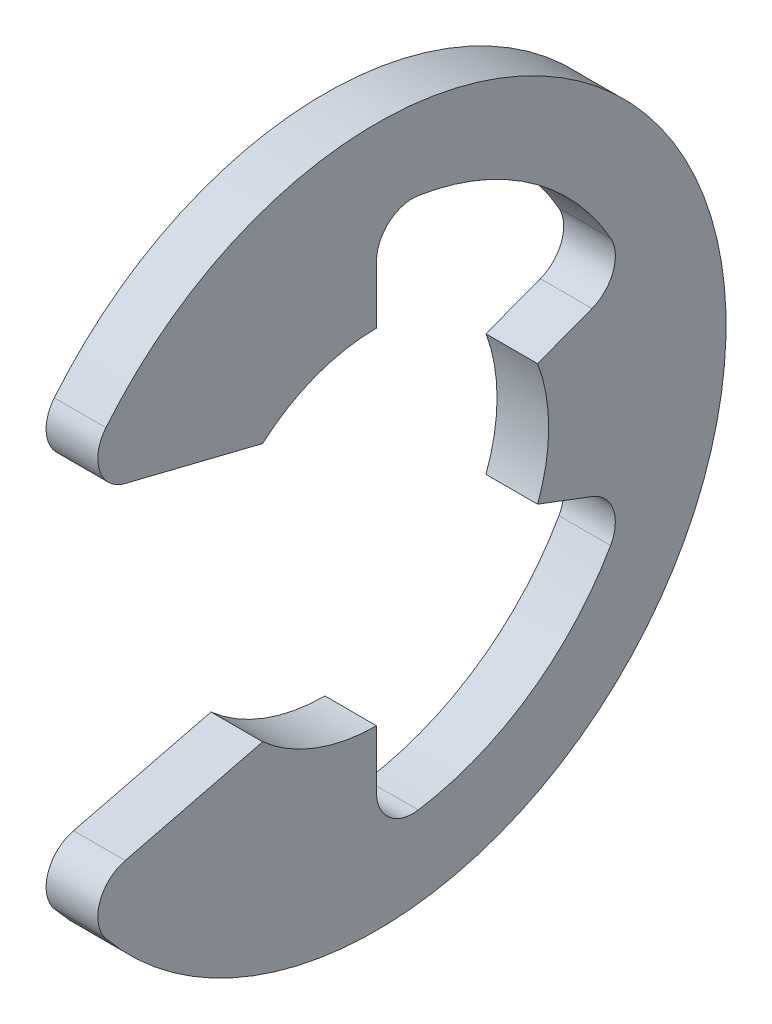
ISO-10303-21;
HEADER;
FILE_DESCRIPTION(('STEP AP214'),'2;1');
FILE_NAME('part.step','',(''),(''),'','','');
FILE_SCHEMA(('AUTOMOTIVE_DESIGN { 1 0 10303 214 1 1 1 1 }'));
ENDSEC;
DATA;
#1=APPLICATION_CONTEXT('core data for automotive mechanical design processes');
#2=APPLICATION_PROTOCOL_DEFINITION('international standard','automotive_design',2000,#1);
#3=PRODUCT_CONTEXT('',#1,'mechanical');
#4=PRODUCT('Part','Part','',(#3));
#5=PRODUCT_RELATED_PRODUCT_CATEGORY('part','',(#4));
#6=PRODUCT_DEFINITION_FORMATION('','',#4);
#7=PRODUCT_DEFINITION_CONTEXT('part definition',#1,'design');
#8=PRODUCT_DEFINITION('design','',#6,#7);
#9=PRODUCT_DEFINITION_SHAPE('','',#8);
#10=(LENGTH_UNIT() NAMED_UNIT(*) SI_UNIT(.MILLI.,.METRE.));
#11=(NAMED_UNIT(*) PLANE_ANGLE_UNIT() SI_UNIT($,.RADIAN.));
#12=(NAMED_UNIT(*) SI_UNIT($,.STERADIAN.) SOLID_ANGLE_UNIT());
#13=UNCERTAINTY_MEASURE_WITH_UNIT(LENGTH_MEASURE(1.E-05),#10,'distance_accuracy_value','');
#14=(GEOMETRIC_REPRESENTATION_CONTEXT(3) GLOBAL_UNCERTAINTY_ASSIGNED_CONTEXT((#13)) GLOBAL_UNIT_ASSIGNED_CONTEXT((#10,
#11,#12)) REPRESENTATION_CONTEXT('',''));
#15=CARTESIAN_POINT('',(0.,0.,0.));
#16=DIRECTION('',(0.,0.,1.));
#17=DIRECTION('',(1.,0.,0.));
#18=AXIS2_PLACEMENT_3D('',#15,#16,#17);
#19=CARTESIAN_POINT('',(0.1905,0.,0.));
#20=DIRECTION('',(-1.,0.,0.));
#21=DIRECTION('',(0.,0.,1.));
#22=AXIS2_PLACEMENT_3D('',#19,#20,#21);
#23=CYLINDRICAL_SURFACE('',#22,2.5781);
#24=CARTESIAN_POINT('',(0.1905,0.,0.));
#25=DIRECTION('',(1.,0.,0.));
#26=DIRECTION('',(0.,0.,-1.));
#27=AXIS2_PLACEMENT_3D('',#24,#25,#26);
#28=CIRCLE('',#27,2.5781);
#29=CARTESIAN_POINT('',(0.1905,-1.63181917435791,1.99593732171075));
#30=VERTEX_POINT('',#29);
#31=CARTESIAN_POINT('',(0.1905,1.63181917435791,1.99593732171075));
#32=VERTEX_POINT('',#31);
#33=EDGE_CURVE('E215',#30,#32,#28,.T.);
#34=ORIENTED_EDGE('',*,*,#33,.F.);
#35=DIRECTION('',(-1.,0.,0.));
#36=VECTOR('',#35,1.);
#37=CARTESIAN_POINT('',(0.1905,-1.63181917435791,1.99593732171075));
#38=LINE('',#37,#36);
#39=CARTESIAN_POINT('',(-0.1905,-1.63181917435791,1.99593732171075));
#40=VERTEX_POINT('',#39);
#41=EDGE_CURVE('E344',#30,#40,#38,.T.);
#42=ORIENTED_EDGE('',*,*,#41,.T.);
#43=CARTESIAN_POINT('',(-0.1905,0.,0.));
#44=DIRECTION('',(1.,0.,0.));
#45=DIRECTION('',(0.,0.,-1.));
#46=AXIS2_PLACEMENT_3D('',#43,#44,#45);
#47=CIRCLE('',#46,2.5781);
#48=CARTESIAN_POINT('',(-0.1905,1.63181917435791,1.99593732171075));
#49=VERTEX_POINT('',#48);
#50=EDGE_CURVE('E265',#40,#49,#47,.T.);
#51=ORIENTED_EDGE('',*,*,#50,.T.);
#52=DIRECTION('',(-1.,0.,0.));
#53=VECTOR('',#52,1.);
#54=CARTESIAN_POINT('',(0.1905,1.63181917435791,1.99593732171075));
#55=LINE('',#54,#53);
#56=EDGE_CURVE('E342',#49,#32,#55,.F.);
#57=ORIENTED_EDGE('',*,*,#56,.T.);
#58=EDGE_LOOP('',(#34,#42,#51,#57));
#59=FACE_BOUND('',#58,.T.);
#60=ADVANCED_FACE('F39',(#59),#23,.T.);
#61=CARTESIAN_POINT('',(0.1905,1.29709748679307,2.22803449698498));
#62=DIRECTION('',(0.,0.970536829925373,-0.240952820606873));
#63=DIRECTION('',(0.,0.240952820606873,0.970536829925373));
#64=AXIS2_PLACEMENT_3D('',#61,#62,#63);
#65=PLANE('',#64);
#66=DIRECTION('',(0.,-0.240952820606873,-0.970536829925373));
#67=VECTOR('',#66,1.);
#68=CARTESIAN_POINT('',(0.1905,1.29709748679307,2.22803449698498));
#69=LINE('',#68,#67);
#70=CARTESIAN_POINT('',(0.1905,1.20416812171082,1.85372316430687));
#71=VERTEX_POINT('',#70);
#72=CARTESIAN_POINT('',(0.1905,0.9525,0.840026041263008));
#73=VERTEX_POINT('',#72);
#74=EDGE_CURVE('E200',#71,#73,#69,.T.);
#75=ORIENTED_EDGE('',*,*,#74,.F.);
#76=DIRECTION('',(-1.,0.,0.));
#77=VECTOR('',#76,1.);
#78=CARTESIAN_POINT('',(0.1905,1.20416812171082,1.85372316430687));
#79=LINE('',#78,#77);
#80=CARTESIAN_POINT('',(-0.1905,1.20416812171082,1.85372316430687));
#81=VERTEX_POINT('',#80);
#82=EDGE_CURVE('E362',#71,#81,#79,.T.);
#83=ORIENTED_EDGE('',*,*,#82,.T.);
#84=DIRECTION('',(0.,-0.240952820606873,-0.970536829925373));
#85=VECTOR('',#84,1.);
#86=CARTESIAN_POINT('',(-0.1905,1.29709748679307,2.22803449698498));
#87=LINE('',#86,#85);
#88=CARTESIAN_POINT('',(-0.1905,0.9525,0.840026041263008));
#89=VERTEX_POINT('',#88);
#90=EDGE_CURVE('E221',#81,#89,#87,.T.);
#91=ORIENTED_EDGE('',*,*,#90,.T.);
#92=DIRECTION('',(-1.,0.,0.));
#93=VECTOR('',#92,1.);
#94=CARTESIAN_POINT('',(0.1905,0.9525,0.840026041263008));
#95=LINE('',#94,#93);
#96=EDGE_CURVE('E218',#73,#89,#95,.T.);
#97=ORIENTED_EDGE('',*,*,#96,.F.);
#98=EDGE_LOOP('',(#75,#83,#91,#97));
#99=FACE_BOUND('',#98,.T.);
#100=ADVANCED_FACE('F219',(#99),#65,.F.);
#101=CARTESIAN_POINT('',(0.1905,0.,0.));
#102=DIRECTION('',(-1.,0.,0.));
#103=DIRECTION('',(0.,0.,1.));
#104=AXIS2_PLACEMENT_3D('',#101,#102,#103);
#105=CYLINDRICAL_SURFACE('',#104,1.27);
#106=CARTESIAN_POINT('',(-0.1905,0.,0.));
#107=DIRECTION('',(-1.,0.,0.));
#108=DIRECTION('',(0.,0.,1.));
#109=AXIS2_PLACEMENT_3D('',#106,#107,#108);
#110=CIRCLE('',#109,1.27);
#111=CARTESIAN_POINT('',(-0.1905,1.27,0.));
#112=VERTEX_POINT('',#111);
#113=EDGE_CURVE('E271',#89,#112,#110,.T.);
#114=ORIENTED_EDGE('',*,*,#113,.T.);
#115=DIRECTION('',(-1.,0.,0.));
#116=VECTOR('',#115,1.);
#117=CARTESIAN_POINT('',(0.1905,1.27,0.));
#118=LINE('',#117,#116);
#119=CARTESIAN_POINT('',(0.1905,1.27,0.));
#120=VERTEX_POINT('',#119);
#121=EDGE_CURVE('E226',#120,#112,#118,.T.);
#122=ORIENTED_EDGE('',*,*,#121,.F.);
#123=CARTESIAN_POINT('',(0.1905,0.,0.));
#124=DIRECTION('',(-1.,0.,0.));
#125=DIRECTION('',(0.,0.,1.));
#126=AXIS2_PLACEMENT_3D('',#123,#124,#125);
#127=CIRCLE('',#126,1.27);
#128=EDGE_CURVE('E206',#73,#120,#127,.T.);
#129=ORIENTED_EDGE('',*,*,#128,.F.);
#130=ORIENTED_EDGE('',*,*,#96,.T.);
#131=EDGE_LOOP('',(#114,#122,#129,#130));
#132=FACE_BOUND('',#131,.T.);
#133=ADVANCED_FACE('F228',(#132),#105,.F.);
#134=CARTESIAN_POINT('',(0.1905,1.27,0.));
#135=DIRECTION('',(0.,0.,1.));
#136=DIRECTION('',(0.,-1.,0.));
#137=AXIS2_PLACEMENT_3D('',#134,#135,#136);
#138=PLANE('',#137);
#139=DIRECTION('',(0.,1.,0.));
#140=VECTOR('',#139,1.);
#141=CARTESIAN_POINT('',(-0.1905,1.27,0.));
#142=LINE('',#141,#140);
#143=CARTESIAN_POINT('',(-0.1905,1.69860617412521,0.));
#144=VERTEX_POINT('',#143);
#145=EDGE_CURVE('E274',#112,#144,#142,.T.);
#146=ORIENTED_EDGE('',*,*,#145,.T.);
#147=DIRECTION('',(1.,0.,0.));
#148=VECTOR('',#147,1.);
#149=CARTESIAN_POINT('',(0.1905,1.69860617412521,0.));
#150=LINE('',#149,#148);
#151=CARTESIAN_POINT('',(0.1905,1.69860617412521,0.));
#152=VERTEX_POINT('',#151);
#153=EDGE_CURVE('E339',#144,#152,#150,.T.);
#154=ORIENTED_EDGE('',*,*,#153,.T.);
#155=DIRECTION('',(0.,1.,0.));
#156=VECTOR('',#155,1.);
#157=CARTESIAN_POINT('',(0.1905,1.27,0.));
#158=LINE('',#157,#156);
#159=EDGE_CURVE('E232',#120,#152,#158,.T.);
#160=ORIENTED_EDGE('',*,*,#159,.F.);
#161=ORIENTED_EDGE('',*,*,#121,.T.);
#162=EDGE_LOOP('',(#146,#154,#160,#161));
#163=FACE_BOUND('',#162,.T.);
#164=ADVANCED_FACE('F479',(#163),#138,.F.);
#165=CARTESIAN_POINT('',(0.1905,0.,0.));
#166=DIRECTION('',(-1.,0.,0.));
#167=DIRECTION('',(0.,0.,1.));
#168=AXIS2_PLACEMENT_3D('',#165,#166,#167);
#169=CYLINDRICAL_SURFACE('',#168,1.98611612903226);
#170=CARTESIAN_POINT('',(0.1905,0.,0.));
#171=DIRECTION('',(-1.,0.,0.));
#172=DIRECTION('',(0.,0.,-1.));
#173=AXIS2_PLACEMENT_3D('',#170,#171,#172);
#174=CIRCLE('',#173,1.98611612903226);
#175=CARTESIAN_POINT('',(0.1905,1.96207832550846,-0.308068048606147));
#176=VERTEX_POINT('',#175);
#177=CARTESIAN_POINT('',(0.1905,0.981870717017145,-1.72643771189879));
#178=VERTEX_POINT('',#177);
#179=EDGE_CURVE('E236',#176,#178,#174,.T.);
#180=ORIENTED_EDGE('',*,*,#179,.F.);
#181=DIRECTION('',(-1.,0.,0.));
#182=VECTOR('',#181,1.);
#183=CARTESIAN_POINT('',(0.1905,1.96207832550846,-0.308068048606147));
#184=LINE('',#183,#182);
#185=CARTESIAN_POINT('',(-0.1905,1.96207832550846,-0.308068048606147));
#186=VERTEX_POINT('',#185);
#187=EDGE_CURVE('E335',#176,#186,#184,.T.);
#188=ORIENTED_EDGE('',*,*,#187,.T.);
#189=CARTESIAN_POINT('',(-0.1905,0.,0.));
#190=DIRECTION('',(-1.,0.,0.));
#191=DIRECTION('',(0.,0.,-1.));
#192=AXIS2_PLACEMENT_3D('',#189,#190,#191);
#193=CIRCLE('',#192,1.98611612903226);
#194=CARTESIAN_POINT('',(-0.1905,0.981870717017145,-1.72643771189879));
#195=VERTEX_POINT('',#194);
#196=EDGE_CURVE('E278',#186,#195,#193,.T.);
#197=ORIENTED_EDGE('',*,*,#196,.T.);
#198=DIRECTION('',(-1.,0.,0.));
#199=VECTOR('',#198,1.);
#200=CARTESIAN_POINT('',(0.1905,0.981870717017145,-1.72643771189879));
#201=LINE('',#200,#199);
#202=EDGE_CURVE('E332',#195,#178,#201,.F.);
#203=ORIENTED_EDGE('',*,*,#202,.T.);
#204=EDGE_LOOP('',(#180,#188,#197,#203));
#205=FACE_BOUND('',#204,.T.);
#206=ADVANCED_FACE('F400',(#205),#169,.F.);
#207=CARTESIAN_POINT('',(0.1905,0.449012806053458,-1.18797622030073));
#208=DIRECTION('',(0.,-0.935414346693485,-0.353553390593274));
#209=DIRECTION('',(0.,0.353553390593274,-0.935414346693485));
#210=AXIS2_PLACEMENT_3D('',#207,#208,#209);
#211=PLANE('',#210);
#212=DIRECTION('',(0.,-0.353553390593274,0.935414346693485));
#213=VECTOR('',#212,1.);
#214=CARTESIAN_POINT('',(0.1905,0.449012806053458,-1.18797622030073));
#215=LINE('',#214,#213);
#216=CARTESIAN_POINT('',(0.1905,0.600547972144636,-1.58890058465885));
#217=VERTEX_POINT('',#216);
#218=CARTESIAN_POINT('',(0.1905,0.449012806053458,-1.18797622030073));
#219=VERTEX_POINT('',#218);
#220=EDGE_CURVE('E242',#217,#219,#215,.T.);
#221=ORIENTED_EDGE('',*,*,#220,.F.);
#222=DIRECTION('',(1.,0.,0.));
#223=VECTOR('',#222,1.);
#224=CARTESIAN_POINT('',(-0.1905,0.600547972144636,-1.58890058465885));
#225=LINE('',#224,#223);
#226=CARTESIAN_POINT('',(-0.1905,0.600547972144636,-1.58890058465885));
#227=VERTEX_POINT('',#226);
#228=EDGE_CURVE('E367',#217,#227,#225,.F.);
#229=ORIENTED_EDGE('',*,*,#228,.T.);
#230=DIRECTION('',(0.,-0.353553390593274,0.935414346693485));
#231=VECTOR('',#230,1.);
#232=CARTESIAN_POINT('',(-0.1905,0.449012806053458,-1.18797622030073));
#233=LINE('',#232,#231);
#234=CARTESIAN_POINT('',(-0.1905,0.449012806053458,-1.18797622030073));
#235=VERTEX_POINT('',#234);
#236=EDGE_CURVE('E282',#227,#235,#233,.T.);
#237=ORIENTED_EDGE('',*,*,#236,.T.);
#238=DIRECTION('',(-1.,0.,0.));
#239=VECTOR('',#238,1.);
#240=CARTESIAN_POINT('',(0.1905,0.449012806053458,-1.18797622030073));
#241=LINE('',#240,#239);
#242=EDGE_CURVE('E316',#219,#235,#241,.T.);
#243=ORIENTED_EDGE('',*,*,#242,.F.);
#244=EDGE_LOOP('',(#221,#229,#237,#243));
#245=FACE_BOUND('',#244,.T.);
#246=ADVANCED_FACE('F403',(#245),#211,.F.);
#247=CARTESIAN_POINT('',(0.1905,0.,0.));
#248=DIRECTION('',(-1.,0.,0.));
#249=DIRECTION('',(0.,0.,1.));
#250=AXIS2_PLACEMENT_3D('',#247,#248,#249);
#251=CYLINDRICAL_SURFACE('',#250,1.27);
#252=CARTESIAN_POINT('',(-0.1905,0.,0.));
#253=DIRECTION('',(-1.,0.,0.));
#254=DIRECTION('',(0.,0.,1.));
#255=AXIS2_PLACEMENT_3D('',#252,#253,#254);
#256=CIRCLE('',#255,1.27);
#257=CARTESIAN_POINT('',(-0.1905,-0.449012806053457,-1.18797622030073));
#258=VERTEX_POINT('',#257);
#259=EDGE_CURVE('E285',#235,#258,#256,.T.);
#260=ORIENTED_EDGE('',*,*,#259,.T.);
#261=DIRECTION('',(-1.,0.,0.));
#262=VECTOR('',#261,1.);
#263=CARTESIAN_POINT('',(0.1905,-0.449012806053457,-1.18797622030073));
#264=LINE('',#263,#262);
#265=CARTESIAN_POINT('',(0.1905,-0.449012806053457,-1.18797622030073));
#266=VERTEX_POINT('',#265);
#267=EDGE_CURVE('E312',#266,#258,#264,.T.);
#268=ORIENTED_EDGE('',*,*,#267,.F.);
#269=CARTESIAN_POINT('',(0.1905,0.,0.));
#270=DIRECTION('',(-1.,0.,0.));
#271=DIRECTION('',(0.,0.,1.));
#272=AXIS2_PLACEMENT_3D('',#269,#270,#271);
#273=CIRCLE('',#272,1.27);
#274=EDGE_CURVE('E245',#219,#266,#273,.T.);
#275=ORIENTED_EDGE('',*,*,#274,.F.);
#276=ORIENTED_EDGE('',*,*,#242,.T.);
#277=EDGE_LOOP('',(#260,#268,#275,#276));
#278=FACE_BOUND('',#277,.T.);
#279=ADVANCED_FACE('F409',(#278),#251,.F.);
#280=CARTESIAN_POINT('',(0.1905,-0.449012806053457,-1.18797622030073));
#281=DIRECTION('',(0.,0.935414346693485,-0.353553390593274));
#282=DIRECTION('',(0.,0.353553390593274,0.935414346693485));
#283=AXIS2_PLACEMENT_3D('',#280,#281,#282);
#284=PLANE('',#283);
#285=DIRECTION('',(0.,-0.353553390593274,-0.935414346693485));
#286=VECTOR('',#285,1.);
#287=CARTESIAN_POINT('',(-0.1905,-0.449012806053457,-1.18797622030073));
#288=LINE('',#287,#286);
#289=CARTESIAN_POINT('',(-0.1905,-0.600547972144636,-1.58890058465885));
#290=VERTEX_POINT('',#289);
#291=EDGE_CURVE('E288',#258,#290,#288,.T.);
#292=ORIENTED_EDGE('',*,*,#291,.T.);
#293=DIRECTION('',(1.,0.,0.));
#294=VECTOR('',#293,1.);
#295=CARTESIAN_POINT('',(0.1905,-0.600547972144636,-1.58890058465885));
#296=LINE('',#295,#294);
#297=CARTESIAN_POINT('',(0.1905,-0.600547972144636,-1.58890058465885));
#298=VERTEX_POINT('',#297);
#299=EDGE_CURVE('E58',#290,#298,#296,.T.);
#300=ORIENTED_EDGE('',*,*,#299,.T.);
#301=DIRECTION('',(0.,-0.353553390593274,-0.935414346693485));
#302=VECTOR('',#301,1.);
#303=CARTESIAN_POINT('',(0.1905,-0.449012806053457,-1.18797622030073));
#304=LINE('',#303,#302);
#305=EDGE_CURVE('E248',#266,#298,#304,.T.);
#306=ORIENTED_EDGE('',*,*,#305,.F.);
#307=ORIENTED_EDGE('',*,*,#267,.T.);
#308=EDGE_LOOP('',(#292,#300,#306,#307));
#309=FACE_BOUND('',#308,.T.);
#310=ADVANCED_FACE('F411',(#309),#284,.F.);
#311=CARTESIAN_POINT('',(0.1905,0.,0.));
#312=DIRECTION('',(-1.,0.,0.));
#313=DIRECTION('',(0.,0.,1.));
#314=AXIS2_PLACEMENT_3D('',#311,#312,#313);
#315=CYLINDRICAL_SURFACE('',#314,1.98611612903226);
#316=CARTESIAN_POINT('',(-0.1905,0.,0.));
#317=DIRECTION('',(-1.,0.,0.));
#318=DIRECTION('',(0.,0.,-1.));
#319=AXIS2_PLACEMENT_3D('',#316,#317,#318);
#320=CIRCLE('',#319,1.98611612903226);
#321=CARTESIAN_POINT('',(-0.1905,-0.981870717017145,-1.72643771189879));
#322=VERTEX_POINT('',#321);
#323=CARTESIAN_POINT('',(-0.1905,-1.96207832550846,-0.308068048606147));
#324=VERTEX_POINT('',#323);
#325=EDGE_CURVE('E291',#322,#324,#320,.T.);
#326=ORIENTED_EDGE('',*,*,#325,.T.);
#327=DIRECTION('',(-1.,0.,0.));
#328=VECTOR('',#327,1.);
#329=CARTESIAN_POINT('',(0.1905,-1.96207832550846,-0.308068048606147));
#330=LINE('',#329,#328);
#331=CARTESIAN_POINT('',(0.1905,-1.96207832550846,-0.308068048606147));
#332=VERTEX_POINT('',#331);
#333=EDGE_CURVE('E329',#324,#332,#330,.F.);
#334=ORIENTED_EDGE('',*,*,#333,.T.);
#335=CARTESIAN_POINT('',(0.1905,0.,0.));
#336=DIRECTION('',(-1.,0.,0.));
#337=DIRECTION('',(0.,0.,-1.));
#338=AXIS2_PLACEMENT_3D('',#335,#336,#337);
#339=CIRCLE('',#338,1.98611612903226);
#340=CARTESIAN_POINT('',(0.1905,-0.981870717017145,-1.72643771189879));
#341=VERTEX_POINT('',#340);
#342=EDGE_CURVE('E251',#341,#332,#339,.T.);
#343=ORIENTED_EDGE('',*,*,#342,.F.);
#344=DIRECTION('',(-1.,0.,0.));
#345=VECTOR('',#344,1.);
#346=CARTESIAN_POINT('',(0.1905,-0.981870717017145,-1.72643771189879));
#347=LINE('',#346,#345);
#348=EDGE_CURVE('E325',#341,#322,#347,.T.);
#349=ORIENTED_EDGE('',*,*,#348,.T.);
#350=EDGE_LOOP('',(#326,#334,#343,#349));
#351=FACE_BOUND('',#350,.T.);
#352=ADVANCED_FACE('F413',(#351),#315,.F.);
#353=CARTESIAN_POINT('',(0.1905,-1.27,0.));
#354=DIRECTION('',(0.,0.,1.));
#355=DIRECTION('',(0.,-1.,0.));
#356=AXIS2_PLACEMENT_3D('',#353,#354,#355);
#357=PLANE('',#356);
#358=DIRECTION('',(0.,1.,0.));
#359=VECTOR('',#358,1.);
#360=CARTESIAN_POINT('',(0.1905,-1.27,0.));
#361=LINE('',#360,#359);
#362=CARTESIAN_POINT('',(0.1905,-1.69860617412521,0.));
#363=VERTEX_POINT('',#362);
#364=CARTESIAN_POINT('',(0.1905,-1.27,0.));
#365=VERTEX_POINT('',#364);
#366=EDGE_CURVE('E255',#363,#365,#361,.T.);
#367=ORIENTED_EDGE('',*,*,#366,.F.);
#368=DIRECTION('',(1.,0.,0.));
#369=VECTOR('',#368,1.);
#370=CARTESIAN_POINT('',(-0.1905,-1.69860617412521,0.));
#371=LINE('',#370,#369);
#372=CARTESIAN_POINT('',(-0.1905,-1.69860617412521,0.));
#373=VERTEX_POINT('',#372);
#374=EDGE_CURVE('E225',#363,#373,#371,.F.);
#375=ORIENTED_EDGE('',*,*,#374,.T.);
#376=DIRECTION('',(0.,1.,0.));
#377=VECTOR('',#376,1.);
#378=CARTESIAN_POINT('',(-0.1905,-1.27,0.));
#379=LINE('',#378,#377);
#380=CARTESIAN_POINT('',(-0.1905,-1.27,0.));
#381=VERTEX_POINT('',#380);
#382=EDGE_CURVE('E295',#373,#381,#379,.T.);
#383=ORIENTED_EDGE('',*,*,#382,.T.);
#384=DIRECTION('',(-1.,0.,0.));
#385=VECTOR('',#384,1.);
#386=CARTESIAN_POINT('',(0.1905,-1.27,0.));
#387=LINE('',#386,#385);
#388=EDGE_CURVE('E308',#365,#381,#387,.T.);
#389=ORIENTED_EDGE('',*,*,#388,.F.);
#390=EDGE_LOOP('',(#367,#375,#383,#389));
#391=FACE_BOUND('',#390,.T.);
#392=ADVANCED_FACE('F419',(#391),#357,.F.);
#393=CARTESIAN_POINT('',(0.1905,0.,0.));
#394=DIRECTION('',(-1.,0.,0.));
#395=DIRECTION('',(0.,0.,1.));
#396=AXIS2_PLACEMENT_3D('',#393,#394,#395);
#397=CYLINDRICAL_SURFACE('',#396,1.27);
#398=CARTESIAN_POINT('',(-0.1905,0.,0.));
#399=DIRECTION('',(-1.,0.,0.));
#400=DIRECTION('',(0.,0.,-1.));
#401=AXIS2_PLACEMENT_3D('',#398,#399,#400);
#402=CIRCLE('',#401,1.27);
#403=CARTESIAN_POINT('',(-0.1905,-0.9525,0.840026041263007));
#404=VERTEX_POINT('',#403);
#405=EDGE_CURVE('E298',#381,#404,#402,.T.);
#406=ORIENTED_EDGE('',*,*,#405,.T.);
#407=DIRECTION('',(-1.,0.,0.));
#408=VECTOR('',#407,1.);
#409=CARTESIAN_POINT('',(0.1905,-0.9525,0.840026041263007));
#410=LINE('',#409,#408);
#411=CARTESIAN_POINT('',(0.1905,-0.9525,0.840026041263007));
#412=VERTEX_POINT('',#411);
#413=EDGE_CURVE('E264',#412,#404,#410,.T.);
#414=ORIENTED_EDGE('',*,*,#413,.F.);
#415=CARTESIAN_POINT('',(0.1905,0.,0.));
#416=DIRECTION('',(-1.,0.,0.));
#417=DIRECTION('',(0.,0.,-1.));
#418=AXIS2_PLACEMENT_3D('',#415,#416,#417);
#419=CIRCLE('',#418,1.27);
#420=EDGE_CURVE('E258',#365,#412,#419,.T.);
#421=ORIENTED_EDGE('',*,*,#420,.F.);
#422=ORIENTED_EDGE('',*,*,#388,.T.);
#423=EDGE_LOOP('',(#406,#414,#421,#422));
#424=FACE_BOUND('',#423,.T.);
#425=ADVANCED_FACE('F468',(#424),#397,.F.);
#426=CARTESIAN_POINT('',(0.1905,-1.29709748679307,2.22803449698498));
#427=DIRECTION('',(0.,-0.970536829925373,-0.240952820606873));
#428=DIRECTION('',(0.,0.240952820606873,-0.970536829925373));
#429=AXIS2_PLACEMENT_3D('',#426,#427,#428);
#430=PLANE('',#429);
#431=DIRECTION('',(0.,-0.240952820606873,0.970536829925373));
#432=VECTOR('',#431,1.);
#433=CARTESIAN_POINT('',(-0.1905,-1.29709748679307,2.22803449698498));
#434=LINE('',#433,#432);
#435=CARTESIAN_POINT('',(-0.1905,-1.20416812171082,1.85372316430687));
#436=VERTEX_POINT('',#435);
#437=EDGE_CURVE('E301',#404,#436,#434,.T.);
#438=ORIENTED_EDGE('',*,*,#437,.T.);
#439=DIRECTION('',(-1.,0.,0.));
#440=VECTOR('',#439,1.);
#441=CARTESIAN_POINT('',(0.1905,-1.20416812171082,1.85372316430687));
#442=LINE('',#441,#440);
#443=CARTESIAN_POINT('',(0.1905,-1.20416812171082,1.85372316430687));
#444=VERTEX_POINT('',#443);
#445=EDGE_CURVE('E354',#436,#444,#442,.F.);
#446=ORIENTED_EDGE('',*,*,#445,.T.);
#447=DIRECTION('',(0.,-0.240952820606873,0.970536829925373));
#448=VECTOR('',#447,1.);
#449=CARTESIAN_POINT('',(0.1905,-1.29709748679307,2.22803449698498));
#450=LINE('',#449,#448);
#451=EDGE_CURVE('E261',#412,#444,#450,.T.);
#452=ORIENTED_EDGE('',*,*,#451,.F.);
#453=ORIENTED_EDGE('',*,*,#413,.T.);
#454=EDGE_LOOP('',(#438,#446,#452,#453));
#455=FACE_BOUND('',#454,.T.);
#456=ADVANCED_FACE('F514',(#455),#430,.F.);
#457=CARTESIAN_POINT('',(0.1905,0.,0.));
#458=DIRECTION('',(1.,0.,0.));
#459=DIRECTION('',(0.,0.,-1.));
#460=AXIS2_PLACEMENT_3D('',#457,#458,#459);
#461=PLANE('',#460);
#462=ORIENTED_EDGE('',*,*,#451,.T.);
#463=CARTESIAN_POINT('',(0.1905,-1.46301029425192,1.78946104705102));
#464=DIRECTION('',(1.,0.,0.));
#465=DIRECTION('',(0.,0.,-1.));
#466=AXIS2_PLACEMENT_3D('',#463,#464,#465);
#467=CIRCLE('',#466,0.2667);
#468=EDGE_CURVE('E359',#444,#30,#467,.T.);
#469=ORIENTED_EDGE('',*,*,#468,.T.);
#470=ORIENTED_EDGE('',*,*,#33,.T.);
#471=CARTESIAN_POINT('',(0.1905,1.46301029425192,1.78946104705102));
#472=DIRECTION('',(1.,0.,0.));
#473=DIRECTION('',(0.,0.,-1.));
#474=AXIS2_PLACEMENT_3D('',#471,#472,#473);
#475=CIRCLE('',#474,0.2667);
#476=EDGE_CURVE('E210',#32,#71,#475,.T.);
#477=ORIENTED_EDGE('',*,*,#476,.T.);
#478=ORIENTED_EDGE('',*,*,#74,.T.);
#479=ORIENTED_EDGE('',*,*,#128,.T.);
#480=ORIENTED_EDGE('',*,*,#159,.T.);
#481=CARTESIAN_POINT('',(0.1905,1.69860617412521,-0.266699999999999));
#482=DIRECTION('',(1.,0.,0.));
#483=DIRECTION('',(0.,0.,-1.));
#484=AXIS2_PLACEMENT_3D('',#481,#482,#483);
#485=CIRCLE('',#484,0.2667);
#486=EDGE_CURVE('E380',#152,#176,#485,.F.);
#487=ORIENTED_EDGE('',*,*,#486,.T.);
#488=ORIENTED_EDGE('',*,*,#179,.T.);
#489=CARTESIAN_POINT('',(0.1905,0.850022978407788,-1.49460789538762));
#490=DIRECTION('',(1.,0.,0.));
#491=DIRECTION('',(0.,0.,-1.));
#492=AXIS2_PLACEMENT_3D('',#489,#490,#491);
#493=CIRCLE('',#492,0.2667);
#494=EDGE_CURVE('E11',#178,#217,#493,.F.);
#495=ORIENTED_EDGE('',*,*,#494,.T.);
#496=ORIENTED_EDGE('',*,*,#220,.T.);
#497=ORIENTED_EDGE('',*,*,#274,.T.);
#498=ORIENTED_EDGE('',*,*,#305,.T.);
#499=CARTESIAN_POINT('',(0.1905,-0.850022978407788,-1.49460789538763));
#500=DIRECTION('',(1.,0.,0.));
#501=DIRECTION('',(0.,0.,-1.));
#502=AXIS2_PLACEMENT_3D('',#499,#500,#501);
#503=CIRCLE('',#502,0.2667);
#504=EDGE_CURVE('E386',#298,#341,#503,.F.);
#505=ORIENTED_EDGE('',*,*,#504,.T.);
#506=ORIENTED_EDGE('',*,*,#342,.T.);
#507=CARTESIAN_POINT('',(0.1905,-1.69860617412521,-0.2667));
#508=DIRECTION('',(1.,0.,0.));
#509=DIRECTION('',(0.,0.,-1.));
#510=AXIS2_PLACEMENT_3D('',#507,#508,#509);
#511=CIRCLE('',#510,0.2667);
#512=EDGE_CURVE('E374',#332,#363,#511,.F.);
#513=ORIENTED_EDGE('',*,*,#512,.T.);
#514=ORIENTED_EDGE('',*,*,#366,.T.);
#515=ORIENTED_EDGE('',*,*,#420,.T.);
#516=EDGE_LOOP('',(#462,#469,#470,#477,#478,#479,#480,#487,#488,#495,#496,#497,#498,#505,#506,
#513,#514,#515));
#517=FACE_BOUND('',#516,.T.);
#518=ADVANCED_FACE('F203',(#517),#461,.T.);
#519=CARTESIAN_POINT('',(-0.1905,0.,0.));
#520=DIRECTION('',(1.,0.,0.));
#521=DIRECTION('',(0.,0.,-1.));
#522=AXIS2_PLACEMENT_3D('',#519,#520,#521);
#523=PLANE('',#522);
#524=ORIENTED_EDGE('',*,*,#50,.F.);
#525=CARTESIAN_POINT('',(-0.1905,-1.46301029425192,1.78946104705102));
#526=DIRECTION('',(1.,0.,0.));
#527=DIRECTION('',(0.,0.,-1.));
#528=AXIS2_PLACEMENT_3D('',#525,#526,#527);
#529=CIRCLE('',#528,0.2667);
#530=EDGE_CURVE('E351',#40,#436,#529,.F.);
#531=ORIENTED_EDGE('',*,*,#530,.T.);
#532=ORIENTED_EDGE('',*,*,#437,.F.);
#533=ORIENTED_EDGE('',*,*,#405,.F.);
#534=ORIENTED_EDGE('',*,*,#382,.F.);
#535=CARTESIAN_POINT('',(-0.1905,-1.69860617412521,-0.2667));
#536=DIRECTION('',(1.,0.,0.));
#537=DIRECTION('',(0.,0.,-1.));
#538=AXIS2_PLACEMENT_3D('',#535,#536,#537);
#539=CIRCLE('',#538,0.2667);
#540=EDGE_CURVE('E371',#373,#324,#539,.T.);
#541=ORIENTED_EDGE('',*,*,#540,.T.);
#542=ORIENTED_EDGE('',*,*,#325,.F.);
#543=CARTESIAN_POINT('',(-0.1905,-0.850022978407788,-1.49460789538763));
#544=DIRECTION('',(1.,0.,0.));
#545=DIRECTION('',(0.,0.,-1.));
#546=AXIS2_PLACEMENT_3D('',#543,#544,#545);
#547=CIRCLE('',#546,0.2667);
#548=EDGE_CURVE('E383',#322,#290,#547,.T.);
#549=ORIENTED_EDGE('',*,*,#548,.T.);
#550=ORIENTED_EDGE('',*,*,#291,.F.);
#551=ORIENTED_EDGE('',*,*,#259,.F.);
#552=ORIENTED_EDGE('',*,*,#236,.F.);
#553=CARTESIAN_POINT('',(-0.1905,0.850022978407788,-1.49460789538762));
#554=DIRECTION('',(1.,0.,0.));
#555=DIRECTION('',(0.,0.,-1.));
#556=AXIS2_PLACEMENT_3D('',#553,#554,#555);
#557=CIRCLE('',#556,0.2667);
#558=EDGE_CURVE('E48',#227,#195,#557,.T.);
#559=ORIENTED_EDGE('',*,*,#558,.T.);
#560=ORIENTED_EDGE('',*,*,#196,.F.);
#561=CARTESIAN_POINT('',(-0.1905,1.69860617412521,-0.266699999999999));
#562=DIRECTION('',(1.,0.,0.));
#563=DIRECTION('',(0.,0.,-1.));
#564=AXIS2_PLACEMENT_3D('',#561,#562,#563);
#565=CIRCLE('',#564,0.2667);
#566=EDGE_CURVE('E377',#186,#144,#565,.T.);
#567=ORIENTED_EDGE('',*,*,#566,.T.);
#568=ORIENTED_EDGE('',*,*,#145,.F.);
#569=ORIENTED_EDGE('',*,*,#113,.F.);
#570=ORIENTED_EDGE('',*,*,#90,.F.);
#571=CARTESIAN_POINT('',(-0.1905,1.46301029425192,1.78946104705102));
#572=DIRECTION('',(1.,0.,0.));
#573=DIRECTION('',(0.,0.,-1.));
#574=AXIS2_PLACEMENT_3D('',#571,#572,#573);
#575=CIRCLE('',#574,0.2667);
#576=EDGE_CURVE('E348',#81,#49,#575,.F.);
#577=ORIENTED_EDGE('',*,*,#576,.T.);
#578=EDGE_LOOP('',(#524,#531,#532,#533,#534,#541,#542,#549,#550,#551,#552,#559,#560,#567,#568,
#569,#570,#577));
#579=FACE_BOUND('',#578,.T.);
#580=ADVANCED_FACE('F393',(#579),#523,.F.);
#581=CARTESIAN_POINT('',(0.1905,-1.69860617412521,-0.2667));
#582=DIRECTION('',(-1.,0.,0.));
#583=DIRECTION('',(0.,0.,1.));
#584=AXIS2_PLACEMENT_3D('',#581,#582,#583);
#585=CYLINDRICAL_SURFACE('',#584,0.2667);
#586=ORIENTED_EDGE('',*,*,#512,.F.);
#587=ORIENTED_EDGE('',*,*,#333,.F.);
#588=ORIENTED_EDGE('',*,*,#540,.F.);
#589=ORIENTED_EDGE('',*,*,#374,.F.);
#590=EDGE_LOOP('',(#586,#587,#588,#589));
#591=FACE_BOUND('',#590,.T.);
#592=ADVANCED_FACE('F433',(#591),#585,.F.);
#593=CARTESIAN_POINT('',(0.1905,1.69860617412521,-0.266699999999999));
#594=DIRECTION('',(-1.,0.,0.));
#595=DIRECTION('',(0.,0.,1.));
#596=AXIS2_PLACEMENT_3D('',#593,#594,#595);
#597=CYLINDRICAL_SURFACE('',#596,0.2667);
#598=ORIENTED_EDGE('',*,*,#486,.F.);
#599=ORIENTED_EDGE('',*,*,#153,.F.);
#600=ORIENTED_EDGE('',*,*,#566,.F.);
#601=ORIENTED_EDGE('',*,*,#187,.F.);
#602=EDGE_LOOP('',(#598,#599,#600,#601));
#603=FACE_BOUND('',#602,.T.);
#604=ADVANCED_FACE('F436',(#603),#597,.F.);
#605=CARTESIAN_POINT('',(0.1905,-1.46301029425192,1.78946104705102));
#606=DIRECTION('',(-1.,0.,0.));
#607=DIRECTION('',(0.,0.,1.));
#608=AXIS2_PLACEMENT_3D('',#605,#606,#607);
#609=CYLINDRICAL_SURFACE('',#608,0.2667);
#610=ORIENTED_EDGE('',*,*,#468,.F.);
#611=ORIENTED_EDGE('',*,*,#445,.F.);
#612=ORIENTED_EDGE('',*,*,#530,.F.);
#613=ORIENTED_EDGE('',*,*,#41,.F.);
#614=EDGE_LOOP('',(#610,#611,#612,#613));
#615=FACE_BOUND('',#614,.T.);
#616=ADVANCED_FACE('F440',(#615),#609,.T.);
#617=CARTESIAN_POINT('',(0.1905,1.46301029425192,1.78946104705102));
#618=DIRECTION('',(-1.,0.,0.));
#619=DIRECTION('',(0.,0.,1.));
#620=AXIS2_PLACEMENT_3D('',#617,#618,#619);
#621=CYLINDRICAL_SURFACE('',#620,0.2667);
#622=ORIENTED_EDGE('',*,*,#476,.F.);
#623=ORIENTED_EDGE('',*,*,#56,.F.);
#624=ORIENTED_EDGE('',*,*,#576,.F.);
#625=ORIENTED_EDGE('',*,*,#82,.F.);
#626=EDGE_LOOP('',(#622,#623,#624,#625));
#627=FACE_BOUND('',#626,.T.);
#628=ADVANCED_FACE('F444',(#627),#621,.T.);
#629=CARTESIAN_POINT('',(0.1905,-0.850022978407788,-1.49460789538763));
#630=DIRECTION('',(-1.,0.,0.));
#631=DIRECTION('',(0.,0.,1.));
#632=AXIS2_PLACEMENT_3D('',#629,#630,#631);
#633=CYLINDRICAL_SURFACE('',#632,0.2667);
#634=ORIENTED_EDGE('',*,*,#504,.F.);
#635=ORIENTED_EDGE('',*,*,#299,.F.);
#636=ORIENTED_EDGE('',*,*,#548,.F.);
#637=ORIENTED_EDGE('',*,*,#348,.F.);
#638=EDGE_LOOP('',(#634,#635,#636,#637));
#639=FACE_BOUND('',#638,.T.);
#640=ADVANCED_FACE('F447',(#639),#633,.F.);
#641=CARTESIAN_POINT('',(0.1905,0.850022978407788,-1.49460789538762));
#642=DIRECTION('',(-1.,0.,0.));
#643=DIRECTION('',(0.,0.,1.));
#644=AXIS2_PLACEMENT_3D('',#641,#642,#643);
#645=CYLINDRICAL_SURFACE('',#644,0.2667);
#646=ORIENTED_EDGE('',*,*,#494,.F.);
#647=ORIENTED_EDGE('',*,*,#202,.F.);
#648=ORIENTED_EDGE('',*,*,#558,.F.);
#649=ORIENTED_EDGE('',*,*,#228,.F.);
#650=EDGE_LOOP('',(#646,#647,#648,#649));
#651=FACE_BOUND('',#650,.T.);
#652=ADVANCED_FACE('F41',(#651),#645,.F.);
#653=CLOSED_SHELL('',(#60,#100,#133,#164,#206,#246,#279,#310,#352,#392,#425,#456,#518,#580,#592,
#604,#616,#628,#640,#652));
#654=MANIFOLD_SOLID_BREP('B2',#653);
#655=ADVANCED_BREP_SHAPE_REPRESENTATION('',(#18,#654),#14);
#656=SHAPE_DEFINITION_REPRESENTATION(#9,#655);
ENDSEC;
END-ISO-10303-21;
